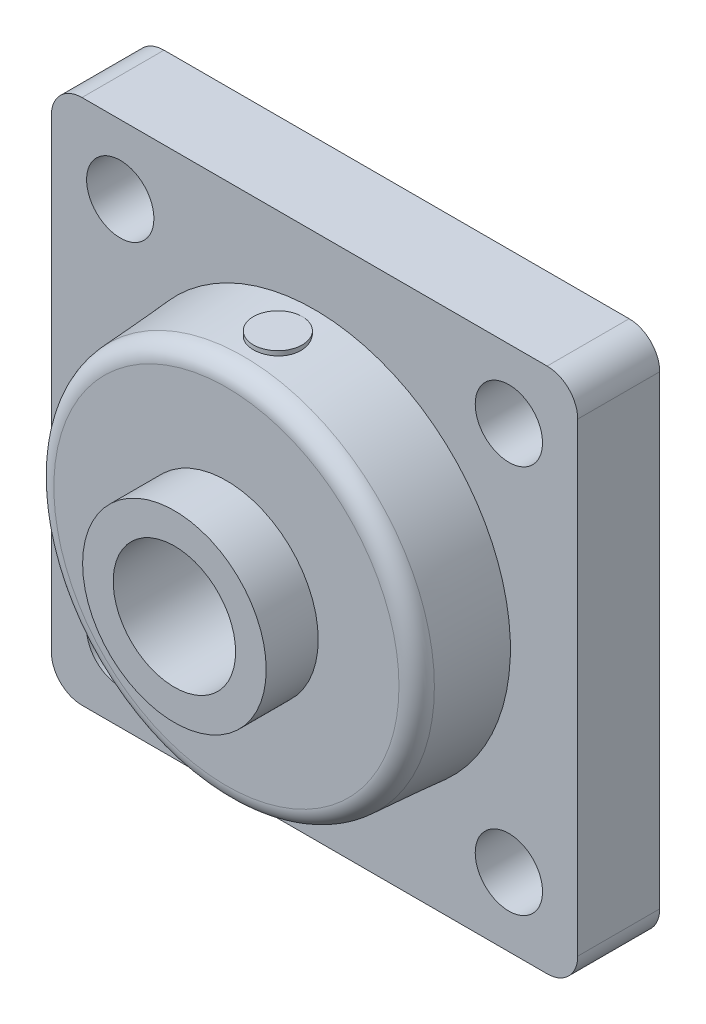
ISO-10303-21;
HEADER;
FILE_DESCRIPTION(('STEP AP214'),'2;1');
FILE_NAME('part.step','',(''),(''),'','','');
FILE_SCHEMA(('AUTOMOTIVE_DESIGN { 1 0 10303 214 1 1 1 1 }'));
ENDSEC;
DATA;
#1=APPLICATION_CONTEXT('core data for automotive mechanical design processes');
#2=APPLICATION_PROTOCOL_DEFINITION('international standard','automotive_design',2000,#1);
#3=PRODUCT_CONTEXT('',#1,'mechanical');
#4=PRODUCT('Part','Part','',(#3));
#5=PRODUCT_RELATED_PRODUCT_CATEGORY('part','',(#4));
#6=PRODUCT_DEFINITION_FORMATION('','',#4);
#7=PRODUCT_DEFINITION_CONTEXT('part definition',#1,'design');
#8=PRODUCT_DEFINITION('design','',#6,#7);
#9=PRODUCT_DEFINITION_SHAPE('','',#8);
#10=(LENGTH_UNIT() NAMED_UNIT(*) SI_UNIT(.MILLI.,.METRE.));
#11=(NAMED_UNIT(*) PLANE_ANGLE_UNIT() SI_UNIT($,.RADIAN.));
#12=(NAMED_UNIT(*) SI_UNIT($,.STERADIAN.) SOLID_ANGLE_UNIT());
#13=UNCERTAINTY_MEASURE_WITH_UNIT(LENGTH_MEASURE(1.E-05),#10,'distance_accuracy_value','');
#14=(GEOMETRIC_REPRESENTATION_CONTEXT(3) GLOBAL_UNCERTAINTY_ASSIGNED_CONTEXT((#13)) GLOBAL_UNIT_ASSIGNED_CONTEXT((#10,
#11,#12)) REPRESENTATION_CONTEXT('',''));
#15=CARTESIAN_POINT('',(0.,0.,0.));
#16=DIRECTION('',(0.,0.,1.));
#17=DIRECTION('',(1.,0.,0.));
#18=AXIS2_PLACEMENT_3D('',#15,#16,#17);
#19=CARTESIAN_POINT('',(0.,0.,13.4));
#20=DIRECTION('',(0.,0.,-1.));
#21=DIRECTION('',(1.,0.,0.));
#22=AXIS2_PLACEMENT_3D('',#19,#20,#21);
#23=CONICAL_SURFACE('',#22,32.,0.0698131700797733);
#24=CARTESIAN_POINT('',(0.,0.,13.4));
#25=DIRECTION('',(0.,0.,-1.));
#26=DIRECTION('',(-1.,0.,0.));
#27=AXIS2_PLACEMENT_3D('',#24,#25,#26);
#28=CIRCLE('',#27,32.);
#29=CARTESIAN_POINT('',(-32.,0.,13.4));
#30=VERTEX_POINT('',#29);
#31=EDGE_CURVE('E133',#30,#30,#28,.F.);
#32=ORIENTED_EDGE('',*,*,#31,.T.);
#33=EDGE_LOOP('',(#32));
#34=FACE_BOUND('',#33,.T.);
#35=CARTESIAN_POINT('',(0.,0.,25.0092694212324));
#36=DIRECTION('',(0.,0.,-1.));
#37=DIRECTION('',(-1.,0.,0.));
#38=AXIS2_PLACEMENT_3D('',#35,#36,#37);
#39=CIRCLE('',#38,31.1882008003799);
#40=CARTESIAN_POINT('',(-31.18820080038,0.,25.0092694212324));
#41=VERTEX_POINT('',#40);
#42=EDGE_CURVE('E55',#41,#41,#39,.T.);
#43=ORIENTED_EDGE('',*,*,#42,.T.);
#44=EDGE_LOOP('',(#43));
#45=FACE_BOUND('',#44,.T.);
#46=CARTESIAN_POINT('',(-2.27490962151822,31.7290569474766,16.1098957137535));
#47=CARTESIAN_POINT('',(-2.46095267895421,31.706697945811,16.2385446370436));
#48=CARTESIAN_POINT('',(-2.63602516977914,31.6823544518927,16.382984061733));
#49=CARTESIAN_POINT('',(-2.95927871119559,31.6315885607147,16.699273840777));
#50=CARTESIAN_POINT('',(-3.10742691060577,31.6051636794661,16.8711572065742));
#51=CARTESIAN_POINT('',(-3.3725345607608,31.5522232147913,17.2373505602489));
#52=CARTESIAN_POINT('',(-3.48951212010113,31.5257076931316,17.4316474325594));
#53=CARTESIAN_POINT('',(-3.68905526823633,31.4744212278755,17.8373229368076));
#54=CARTESIAN_POINT('',(-3.77163013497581,31.4496498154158,18.0486969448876));
#55=CARTESIAN_POINT('',(-3.89999488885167,31.4034035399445,18.482786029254));
#56=CARTESIAN_POINT('',(-3.94576980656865,31.3819300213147,18.7055056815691));
#57=CARTESIAN_POINT('',(-3.99897556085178,31.3434478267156,19.1558671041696));
#58=CARTESIAN_POINT('',(-4.00640729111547,31.3264390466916,19.3835087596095));
#59=CARTESIAN_POINT('',(-3.98265449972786,31.2976629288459,19.8346985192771));
#60=CARTESIAN_POINT('',(-3.95187390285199,31.2858425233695,20.0582645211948));
#61=CARTESIAN_POINT('',(-3.85313665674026,31.2672271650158,20.4972439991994));
#62=CARTESIAN_POINT('',(-3.78518167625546,31.2604319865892,20.7126578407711));
#63=CARTESIAN_POINT('',(-3.6146384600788,31.2514044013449,21.127517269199));
#64=CARTESIAN_POINT('',(-3.51231267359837,31.2491382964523,21.3270700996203));
#65=CARTESIAN_POINT('',(-3.27579971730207,31.2481501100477,21.7063127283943));
#66=CARTESIAN_POINT('',(-3.14161217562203,31.249428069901,21.8860022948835));
#67=CARTESIAN_POINT('',(-2.84486832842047,31.2543312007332,22.2207906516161));
#68=CARTESIAN_POINT('',(-2.68225618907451,31.2579610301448,22.3758398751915));
#69=CARTESIAN_POINT('',(-2.33342198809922,31.2662487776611,22.6565731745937));
#70=CARTESIAN_POINT('',(-2.14719936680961,31.2709067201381,22.7822565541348));
#71=CARTESIAN_POINT('',(-1.7555348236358,31.2800074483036,23.0012000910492));
#72=CARTESIAN_POINT('',(-1.55001500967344,31.2844492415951,23.094320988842));
#73=CARTESIAN_POINT('',(-1.12624067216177,31.2920429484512,23.244754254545));
#74=CARTESIAN_POINT('',(-0.907986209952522,31.2951948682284,23.3020667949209));
#75=CARTESIAN_POINT('',(-0.464941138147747,31.2995135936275,23.3792446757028));
#76=CARTESIAN_POINT('',(-0.240150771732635,31.3006804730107,23.3991114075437));
#77=CARTESIAN_POINT('',(0.209574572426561,31.3007799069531,23.4008301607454));
#78=CARTESIAN_POINT('',(0.434509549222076,31.2997124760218,23.3826824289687));
#79=CARTESIAN_POINT('',(0.877822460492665,31.2955741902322,23.3089450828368));
#80=CARTESIAN_POINT('',(1.09620883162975,31.2925060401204,23.2534060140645));
#81=CARTESIAN_POINT('',(1.52056518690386,31.2850423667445,23.1065208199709));
#82=CARTESIAN_POINT('',(1.7265349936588,31.2806468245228,23.0151741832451));
#83=CARTESIAN_POINT('',(2.12048740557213,31.2715575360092,22.7991268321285));
#84=CARTESIAN_POINT('',(2.30844787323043,31.2668634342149,22.67438576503));
#85=CARTESIAN_POINT('',(2.66078858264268,31.2584526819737,22.395118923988));
#86=CARTESIAN_POINT('',(2.8251687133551,31.2547360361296,22.2405930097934));
#87=CARTESIAN_POINT('',(3.12574113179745,31.2496201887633,21.906057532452));
#88=CARTESIAN_POINT('',(3.2619226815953,31.2482218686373,21.7260383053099));
#89=CARTESIAN_POINT('',(3.50212137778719,31.2489786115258,21.3456952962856));
#90=CARTESIAN_POINT('',(3.60613964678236,31.2511335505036,21.1453722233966));
#91=CARTESIAN_POINT('',(3.77869500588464,31.2599244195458,20.7310246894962));
#92=CARTESIAN_POINT('',(3.84737299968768,31.26654230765,20.5170585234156));
#93=CARTESIAN_POINT('',(3.94797675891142,31.2847432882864,20.0808630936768));
#94=CARTESIAN_POINT('',(3.97990344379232,31.2963262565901,19.8586340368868));
#95=CARTESIAN_POINT('',(4.00619037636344,31.324397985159,19.4128591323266));
#96=CARTESIAN_POINT('',(4.0006471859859,31.3408740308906,19.1893181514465));
#97=CARTESIAN_POINT('',(3.95255408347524,31.3781758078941,18.7466277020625));
#98=CARTESIAN_POINT('',(3.91000272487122,31.3990017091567,18.5274784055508));
#99=CARTESIAN_POINT('',(3.7888424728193,31.4440890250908,18.0981746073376));
#100=CARTESIAN_POINT('',(3.70999608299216,31.4683723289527,17.8880894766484));
#101=CARTESIAN_POINT('',(3.51846933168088,31.5187796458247,17.484187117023));
#102=CARTESIAN_POINT('',(3.40578631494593,31.5449038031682,17.2903711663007));
#103=CARTESIAN_POINT('',(3.1482920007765,31.5975154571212,16.9222479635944));
#104=CARTESIAN_POINT('',(3.00314477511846,31.6240038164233,16.7481756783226));
#105=CARTESIAN_POINT('',(2.68541137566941,31.6751157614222,16.426850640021));
#106=CARTESIAN_POINT('',(2.512824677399,31.6997393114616,16.2795983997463));
#107=CARTESIAN_POINT('',(2.14482831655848,31.7452305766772,16.0160746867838));
#108=CARTESIAN_POINT('',(1.94940644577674,31.7660962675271,15.8998198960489));
#109=CARTESIAN_POINT('',(1.54129925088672,31.8023638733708,15.7019182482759));
#110=CARTESIAN_POINT('',(1.32861610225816,31.8177664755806,15.6202670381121));
#111=CARTESIAN_POINT('',(0.89522261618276,31.8416468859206,15.4950370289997));
#112=CARTESIAN_POINT('',(0.67466855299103,31.8502196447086,15.4509355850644));
#113=CARTESIAN_POINT('',(0.229084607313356,31.8600823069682,15.4002764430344));
#114=CARTESIAN_POINT('',(0.00405419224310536,31.8613713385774,15.3937232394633));
#115=CARTESIAN_POINT('',(-0.440806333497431,31.8565903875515,15.4182071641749));
#116=CARTESIAN_POINT('',(-0.660665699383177,31.8506189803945,15.4487407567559));
#117=CARTESIAN_POINT('',(-1.09188953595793,31.8319744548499,15.5455850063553));
#118=CARTESIAN_POINT('',(-1.30326254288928,31.819308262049,15.6118586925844));
#119=CARTESIAN_POINT('',(-1.6425993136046,31.7935652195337,15.7499025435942));
#120=CARTESIAN_POINT('',(-1.7746092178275,31.782073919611,15.812245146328));
#121=CARTESIAN_POINT('',(-2.03089729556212,31.7570147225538,15.9508435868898));
#122=CARTESIAN_POINT('',(-2.15517545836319,31.7434468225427,16.0270994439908));
#123=CARTESIAN_POINT('',(-2.27490962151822,31.7290569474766,16.1098957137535));
#124=B_SPLINE_CURVE_WITH_KNOTS('',3,(#46,#47,#48,#49,#50,#51,#52,#53,#54,#55,#56,#57,#58,#59,
#60,#61,#62,#63,#64,#65,#66,#67,#68,#69,#70,#71,#72,#73,#74,#75,#76,#77,#78,#79,#80,#81,#82,#83,
#84,#85,#86,#87,#88,#89,#90,#91,#92,#93,#94,#95,#96,#97,#98,#99,#100,#101,#102,#103,#104,#105,
#106,#107,#108,#109,#110,#111,#112,#113,#114,#115,#116,#117,#118,#119,#120,#121,#122,#123),
.UNSPECIFIED.,.T.,.F.,(4,2,2,2,2,2,2,2,2,2,2,2,2,2,2,2,2,2,2,2,2,2,2,2,2,2,2,2,2,2,2,2,2,2,2,2,
2,2,4),(0.,0.681344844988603,1.36351551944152,2.04528901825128,2.7268785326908,3.40874516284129,
4.09059590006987,4.76530008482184,5.43997398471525,6.10960907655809,6.77925198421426,
7.45022534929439,8.12121462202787,8.79503938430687,9.46886090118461,10.1426573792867,
10.8164494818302,11.4893325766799,12.1622252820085,12.8359347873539,13.509647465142,
14.1836162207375,14.857561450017,15.5287983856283,16.2000185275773,16.8695095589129,
17.5390267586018,18.2129886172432,18.8870033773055,19.5683448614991,20.2496993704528,
20.9314198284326,21.6130545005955,22.2850389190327,22.9571037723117,23.620144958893,
24.2825015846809,24.7210029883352,25.1595049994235),.UNSPECIFIED.);
#125=CARTESIAN_POINT('',(-2.27490962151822,31.7290569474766,16.1098957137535));
#126=VERTEX_POINT('',#125);
#127=EDGE_CURVE('E11',#126,#126,#124,.T.);
#128=ORIENTED_EDGE('',*,*,#127,.F.);
#129=EDGE_LOOP('',(#128));
#130=FACE_BOUND('',#129,.T.);
#131=ADVANCED_FACE('F42',(#34,#45,#130),#23,.T.);
#132=CARTESIAN_POINT('',(0.,0.,27.8));
#133=DIRECTION('',(0.,0.,1.));
#134=DIRECTION('',(1.,0.,0.));
#135=AXIS2_PLACEMENT_3D('',#132,#133,#134);
#136=PLANE('',#135);
#137=CARTESIAN_POINT('',(0.,0.,27.8));
#138=DIRECTION('',(0.,0.,1.));
#139=DIRECTION('',(1.,0.,0.));
#140=AXIS2_PLACEMENT_3D('',#137,#138,#139);
#141=CIRCLE('',#140,28.1955086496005);
#142=CARTESIAN_POINT('',(28.1955086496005,0.,27.8));
#143=VERTEX_POINT('',#142);
#144=EDGE_CURVE('E214',#143,#143,#141,.T.);
#145=ORIENTED_EDGE('',*,*,#144,.T.);
#146=EDGE_LOOP('',(#145));
#147=FACE_BOUND('',#146,.T.);
#148=CARTESIAN_POINT('',(0.,0.,27.8));
#149=DIRECTION('',(0.,0.,1.));
#150=DIRECTION('',(1.,0.,0.));
#151=AXIS2_PLACEMENT_3D('',#148,#149,#150);
#152=CIRCLE('',#151,15.);
#153=CARTESIAN_POINT('',(15.,0.,27.8));
#154=VERTEX_POINT('',#153);
#155=EDGE_CURVE('E237',#154,#154,#152,.T.);
#156=ORIENTED_EDGE('',*,*,#155,.F.);
#157=EDGE_LOOP('',(#156));
#158=FACE_BOUND('',#157,.T.);
#159=ADVANCED_FACE('F230',(#147,#158),#136,.T.);
#160=CARTESIAN_POINT('',(38.,-38.,13.4));
#161=DIRECTION('',(0.,0.,-1.));
#162=DIRECTION('',(-1.,0.,0.));
#163=AXIS2_PLACEMENT_3D('',#160,#161,#162);
#164=PLANE('',#163);
#165=CARTESIAN_POINT('',(31.7499999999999,-31.7499999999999,13.4));
#166=DIRECTION('',(0.,0.,1.));
#167=DIRECTION('',(-1.,0.,0.));
#168=AXIS2_PLACEMENT_3D('',#165,#166,#167);
#169=CIRCLE('',#168,5.5);
#170=CARTESIAN_POINT('',(26.2499999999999,-31.7499999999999,13.4));
#171=VERTEX_POINT('',#170);
#172=EDGE_CURVE('E257',#171,#171,#169,.T.);
#173=ORIENTED_EDGE('',*,*,#172,.F.);
#174=EDGE_LOOP('',(#173));
#175=FACE_BOUND('',#174,.T.);
#176=CARTESIAN_POINT('',(31.7499999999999,31.7499999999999,13.4));
#177=DIRECTION('',(0.,0.,1.));
#178=DIRECTION('',(-1.,0.,0.));
#179=AXIS2_PLACEMENT_3D('',#176,#177,#178);
#180=CIRCLE('',#179,5.5);
#181=CARTESIAN_POINT('',(26.2499999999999,31.7499999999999,13.4));
#182=VERTEX_POINT('',#181);
#183=EDGE_CURVE('E272',#182,#182,#180,.T.);
#184=ORIENTED_EDGE('',*,*,#183,.F.);
#185=EDGE_LOOP('',(#184));
#186=FACE_BOUND('',#185,.T.);
#187=CARTESIAN_POINT('',(38.,-38.,13.4));
#188=DIRECTION('',(0.,0.,1.));
#189=DIRECTION('',(-1.,0.,0.));
#190=AXIS2_PLACEMENT_3D('',#187,#188,#189);
#191=CIRCLE('',#190,5.);
#192=CARTESIAN_POINT('',(38.,-43.,13.4));
#193=VERTEX_POINT('',#192);
#194=CARTESIAN_POINT('',(42.9999999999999,-38.,13.4));
#195=VERTEX_POINT('',#194);
#196=EDGE_CURVE('E166',#193,#195,#191,.T.);
#197=ORIENTED_EDGE('',*,*,#196,.T.);
#198=DIRECTION('',(0.,1.,0.));
#199=VECTOR('',#198,1.);
#200=CARTESIAN_POINT('',(42.9999999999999,-38.,13.4));
#201=LINE('',#200,#199);
#202=CARTESIAN_POINT('',(42.9999999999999,38.,13.4));
#203=VERTEX_POINT('',#202);
#204=EDGE_CURVE('E129',#195,#203,#201,.T.);
#205=ORIENTED_EDGE('',*,*,#204,.T.);
#206=CARTESIAN_POINT('',(38.,37.9999999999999,13.4));
#207=DIRECTION('',(0.,0.,1.));
#208=DIRECTION('',(-1.,0.,0.));
#209=AXIS2_PLACEMENT_3D('',#206,#207,#208);
#210=CIRCLE('',#209,5.);
#211=CARTESIAN_POINT('',(38.,42.9999999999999,13.4));
#212=VERTEX_POINT('',#211);
#213=EDGE_CURVE('E171',#203,#212,#210,.T.);
#214=ORIENTED_EDGE('',*,*,#213,.T.);
#215=DIRECTION('',(-1.,0.,0.));
#216=VECTOR('',#215,1.);
#217=CARTESIAN_POINT('',(-38.,43.,13.4));
#218=LINE('',#217,#216);
#219=CARTESIAN_POINT('',(-38.,43.,13.4));
#220=VERTEX_POINT('',#219);
#221=EDGE_CURVE('E174',#212,#220,#218,.T.);
#222=ORIENTED_EDGE('',*,*,#221,.T.);
#223=CARTESIAN_POINT('',(-38.,38.,13.4));
#224=DIRECTION('',(0.,0.,1.));
#225=DIRECTION('',(1.,0.,0.));
#226=AXIS2_PLACEMENT_3D('',#223,#224,#225);
#227=CIRCLE('',#226,5.);
#228=CARTESIAN_POINT('',(-42.9999999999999,37.9999999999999,13.4));
#229=VERTEX_POINT('',#228);
#230=EDGE_CURVE('E177',#220,#229,#227,.T.);
#231=ORIENTED_EDGE('',*,*,#230,.T.);
#232=DIRECTION('',(0.,-1.,0.));
#233=VECTOR('',#232,1.);
#234=CARTESIAN_POINT('',(-42.9999999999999,-38.,13.4));
#235=LINE('',#234,#233);
#236=CARTESIAN_POINT('',(-42.9999999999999,-38.,13.4));
#237=VERTEX_POINT('',#236);
#238=EDGE_CURVE('E180',#229,#237,#235,.T.);
#239=ORIENTED_EDGE('',*,*,#238,.T.);
#240=CARTESIAN_POINT('',(-38.,-38.,13.4));
#241=DIRECTION('',(0.,0.,1.));
#242=DIRECTION('',(1.,0.,0.));
#243=AXIS2_PLACEMENT_3D('',#240,#241,#242);
#244=CIRCLE('',#243,5.);
#245=CARTESIAN_POINT('',(-38.,-43.,13.4));
#246=VERTEX_POINT('',#245);
#247=EDGE_CURVE('E67',#237,#246,#244,.T.);
#248=ORIENTED_EDGE('',*,*,#247,.T.);
#249=DIRECTION('',(1.,0.,0.));
#250=VECTOR('',#249,1.);
#251=CARTESIAN_POINT('',(-38.,-43.,13.4));
#252=LINE('',#251,#250);
#253=EDGE_CURVE('E62',#246,#193,#252,.T.);
#254=ORIENTED_EDGE('',*,*,#253,.T.);
#255=EDGE_LOOP('',(#197,#205,#214,#222,#231,#239,#248,#254));
#256=FACE_BOUND('',#255,.T.);
#257=CARTESIAN_POINT('',(-31.7499999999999,31.7499999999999,13.4));
#258=DIRECTION('',(0.,0.,1.));
#259=DIRECTION('',(1.,0.,0.));
#260=AXIS2_PLACEMENT_3D('',#257,#258,#259);
#261=CIRCLE('',#260,5.5);
#262=CARTESIAN_POINT('',(-26.2499999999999,31.7499999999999,13.4));
#263=VERTEX_POINT('',#262);
#264=EDGE_CURVE('E139',#263,#263,#261,.T.);
#265=ORIENTED_EDGE('',*,*,#264,.F.);
#266=EDGE_LOOP('',(#265));
#267=FACE_BOUND('',#266,.T.);
#268=CARTESIAN_POINT('',(-31.7499999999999,-31.7500000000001,13.4));
#269=DIRECTION('',(0.,0.,1.));
#270=DIRECTION('',(1.,0.,0.));
#271=AXIS2_PLACEMENT_3D('',#268,#269,#270);
#272=CIRCLE('',#271,5.5);
#273=CARTESIAN_POINT('',(-26.2499999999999,-31.7500000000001,13.4));
#274=VERTEX_POINT('',#273);
#275=EDGE_CURVE('E264',#274,#274,#272,.T.);
#276=ORIENTED_EDGE('',*,*,#275,.F.);
#277=EDGE_LOOP('',(#276));
#278=FACE_BOUND('',#277,.T.);
#279=ORIENTED_EDGE('',*,*,#31,.F.);
#280=EDGE_LOOP('',(#279));
#281=FACE_BOUND('',#280,.T.);
#282=ADVANCED_FACE('F233',(#175,#186,#256,#267,#278,#281),#164,.F.);
#283=CARTESIAN_POINT('',(38.,-38.,0.));
#284=DIRECTION('',(0.,0.,-1.));
#285=DIRECTION('',(-1.,0.,0.));
#286=AXIS2_PLACEMENT_3D('',#283,#284,#285);
#287=PLANE('',#286);
#288=CARTESIAN_POINT('',(0.,0.,0.));
#289=DIRECTION('',(0.,0.,1.));
#290=DIRECTION('',(1.,0.,0.));
#291=AXIS2_PLACEMENT_3D('',#288,#289,#290);
#292=CIRCLE('',#291,10.);
#293=CARTESIAN_POINT('',(10.,0.,0.));
#294=VERTEX_POINT('',#293);
#295=EDGE_CURVE('E250',#294,#294,#292,.T.);
#296=ORIENTED_EDGE('',*,*,#295,.T.);
#297=EDGE_LOOP('',(#296));
#298=FACE_BOUND('',#297,.T.);
#299=CARTESIAN_POINT('',(-31.7499999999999,-31.7500000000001,0.));
#300=DIRECTION('',(0.,0.,1.));
#301=DIRECTION('',(1.,0.,0.));
#302=AXIS2_PLACEMENT_3D('',#299,#300,#301);
#303=CIRCLE('',#302,5.5);
#304=CARTESIAN_POINT('',(-26.2499999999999,-31.7500000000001,0.));
#305=VERTEX_POINT('',#304);
#306=EDGE_CURVE('E261',#305,#305,#303,.T.);
#307=ORIENTED_EDGE('',*,*,#306,.T.);
#308=EDGE_LOOP('',(#307));
#309=FACE_BOUND('',#308,.T.);
#310=CARTESIAN_POINT('',(-31.7499999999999,31.7499999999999,0.));
#311=DIRECTION('',(0.,0.,1.));
#312=DIRECTION('',(1.,0.,0.));
#313=AXIS2_PLACEMENT_3D('',#310,#311,#312);
#314=CIRCLE('',#313,5.5);
#315=CARTESIAN_POINT('',(-26.2499999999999,31.7499999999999,0.));
#316=VERTEX_POINT('',#315);
#317=EDGE_CURVE('E145',#316,#316,#314,.T.);
#318=ORIENTED_EDGE('',*,*,#317,.T.);
#319=EDGE_LOOP('',(#318));
#320=FACE_BOUND('',#319,.T.);
#321=CARTESIAN_POINT('',(38.,-38.,0.));
#322=DIRECTION('',(0.,0.,1.));
#323=DIRECTION('',(-1.,0.,0.));
#324=AXIS2_PLACEMENT_3D('',#321,#322,#323);
#325=CIRCLE('',#324,5.);
#326=CARTESIAN_POINT('',(38.,-43.,0.));
#327=VERTEX_POINT('',#326);
#328=CARTESIAN_POINT('',(42.9999999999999,-38.,0.));
#329=VERTEX_POINT('',#328);
#330=EDGE_CURVE('E118',#327,#329,#325,.T.);
#331=ORIENTED_EDGE('',*,*,#330,.F.);
#332=DIRECTION('',(1.,0.,0.));
#333=VECTOR('',#332,1.);
#334=CARTESIAN_POINT('',(-38.,-43.,0.));
#335=LINE('',#334,#333);
#336=CARTESIAN_POINT('',(-38.,-43.,0.));
#337=VERTEX_POINT('',#336);
#338=EDGE_CURVE('E163',#337,#327,#335,.T.);
#339=ORIENTED_EDGE('',*,*,#338,.F.);
#340=CARTESIAN_POINT('',(-38.,-38.,0.));
#341=DIRECTION('',(0.,0.,1.));
#342=DIRECTION('',(1.,0.,0.));
#343=AXIS2_PLACEMENT_3D('',#340,#341,#342);
#344=CIRCLE('',#343,5.);
#345=CARTESIAN_POINT('',(-42.9999999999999,-38.,0.));
#346=VERTEX_POINT('',#345);
#347=EDGE_CURVE('E160',#346,#337,#344,.T.);
#348=ORIENTED_EDGE('',*,*,#347,.F.);
#349=DIRECTION('',(0.,-1.,0.));
#350=VECTOR('',#349,1.);
#351=CARTESIAN_POINT('',(-42.9999999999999,-38.,0.));
#352=LINE('',#351,#350);
#353=CARTESIAN_POINT('',(-42.9999999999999,37.9999999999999,0.));
#354=VERTEX_POINT('',#353);
#355=EDGE_CURVE('E157',#354,#346,#352,.T.);
#356=ORIENTED_EDGE('',*,*,#355,.F.);
#357=CARTESIAN_POINT('',(-38.,38.,0.));
#358=DIRECTION('',(0.,0.,1.));
#359=DIRECTION('',(1.,0.,0.));
#360=AXIS2_PLACEMENT_3D('',#357,#358,#359);
#361=CIRCLE('',#360,5.);
#362=CARTESIAN_POINT('',(-38.,43.,0.));
#363=VERTEX_POINT('',#362);
#364=EDGE_CURVE('E154',#363,#354,#361,.T.);
#365=ORIENTED_EDGE('',*,*,#364,.F.);
#366=DIRECTION('',(-1.,0.,0.));
#367=VECTOR('',#366,1.);
#368=CARTESIAN_POINT('',(-38.,43.,0.));
#369=LINE('',#368,#367);
#370=CARTESIAN_POINT('',(38.,42.9999999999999,0.));
#371=VERTEX_POINT('',#370);
#372=EDGE_CURVE('E151',#371,#363,#369,.T.);
#373=ORIENTED_EDGE('',*,*,#372,.F.);
#374=CARTESIAN_POINT('',(38.,37.9999999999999,0.));
#375=DIRECTION('',(0.,0.,1.));
#376=DIRECTION('',(-1.,0.,0.));
#377=AXIS2_PLACEMENT_3D('',#374,#375,#376);
#378=CIRCLE('',#377,5.);
#379=CARTESIAN_POINT('',(42.9999999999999,38.,0.));
#380=VERTEX_POINT('',#379);
#381=EDGE_CURVE('E120',#380,#371,#378,.T.);
#382=ORIENTED_EDGE('',*,*,#381,.F.);
#383=DIRECTION('',(0.,1.,0.));
#384=VECTOR('',#383,1.);
#385=CARTESIAN_POINT('',(42.9999999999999,-38.,0.));
#386=LINE('',#385,#384);
#387=EDGE_CURVE('E112',#329,#380,#386,.T.);
#388=ORIENTED_EDGE('',*,*,#387,.F.);
#389=EDGE_LOOP('',(#331,#339,#348,#356,#365,#373,#382,#388));
#390=FACE_BOUND('',#389,.T.);
#391=CARTESIAN_POINT('',(31.7499999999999,31.7499999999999,0.));
#392=DIRECTION('',(0.,0.,1.));
#393=DIRECTION('',(-1.,0.,0.));
#394=AXIS2_PLACEMENT_3D('',#391,#392,#393);
#395=CIRCLE('',#394,5.5);
#396=CARTESIAN_POINT('',(26.2499999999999,31.7499999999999,0.));
#397=VERTEX_POINT('',#396);
#398=EDGE_CURVE('E268',#397,#397,#395,.T.);
#399=ORIENTED_EDGE('',*,*,#398,.T.);
#400=EDGE_LOOP('',(#399));
#401=FACE_BOUND('',#400,.T.);
#402=CARTESIAN_POINT('',(31.7499999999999,-31.7499999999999,0.));
#403=DIRECTION('',(0.,0.,1.));
#404=DIRECTION('',(-1.,0.,0.));
#405=AXIS2_PLACEMENT_3D('',#402,#403,#404);
#406=CIRCLE('',#405,5.5);
#407=CARTESIAN_POINT('',(26.2499999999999,-31.7499999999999,0.));
#408=VERTEX_POINT('',#407);
#409=EDGE_CURVE('E246',#408,#408,#406,.T.);
#410=ORIENTED_EDGE('',*,*,#409,.T.);
#411=EDGE_LOOP('',(#410));
#412=FACE_BOUND('',#411,.T.);
#413=ADVANCED_FACE('F114',(#298,#309,#320,#390,#401,#412),#287,.T.);
#414=CARTESIAN_POINT('',(38.,-38.,13.4));
#415=DIRECTION('',(0.,0.,-1.));
#416=DIRECTION('',(-1.,0.,0.));
#417=AXIS2_PLACEMENT_3D('',#414,#415,#416);
#418=CYLINDRICAL_SURFACE('',#417,5.);
#419=ORIENTED_EDGE('',*,*,#330,.T.);
#420=DIRECTION('',(0.,0.,-1.));
#421=VECTOR('',#420,1.);
#422=CARTESIAN_POINT('',(42.9999999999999,-38.,13.4));
#423=LINE('',#422,#421);
#424=EDGE_CURVE('E127',#195,#329,#423,.T.);
#425=ORIENTED_EDGE('',*,*,#424,.F.);
#426=ORIENTED_EDGE('',*,*,#196,.F.);
#427=DIRECTION('',(0.,0.,-1.));
#428=VECTOR('',#427,1.);
#429=CARTESIAN_POINT('',(38.,-43.,13.4));
#430=LINE('',#429,#428);
#431=EDGE_CURVE('E137',#193,#327,#430,.T.);
#432=ORIENTED_EDGE('',*,*,#431,.T.);
#433=EDGE_LOOP('',(#419,#425,#426,#432));
#434=FACE_BOUND('',#433,.T.);
#435=ADVANCED_FACE('F44',(#434),#418,.T.);
#436=CARTESIAN_POINT('',(42.9999999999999,-38.,13.4));
#437=DIRECTION('',(-1.,0.,0.));
#438=DIRECTION('',(0.,0.,1.));
#439=AXIS2_PLACEMENT_3D('',#436,#437,#438);
#440=PLANE('',#439);
#441=ORIENTED_EDGE('',*,*,#387,.T.);
#442=DIRECTION('',(0.,0.,-1.));
#443=VECTOR('',#442,1.);
#444=CARTESIAN_POINT('',(42.9999999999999,38.,13.4));
#445=LINE('',#444,#443);
#446=EDGE_CURVE('E134',#203,#380,#445,.T.);
#447=ORIENTED_EDGE('',*,*,#446,.F.);
#448=ORIENTED_EDGE('',*,*,#204,.F.);
#449=ORIENTED_EDGE('',*,*,#424,.T.);
#450=EDGE_LOOP('',(#441,#447,#448,#449));
#451=FACE_BOUND('',#450,.T.);
#452=ADVANCED_FACE('F128',(#451),#440,.F.);
#453=CARTESIAN_POINT('',(38.,37.9999999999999,13.4));
#454=DIRECTION('',(0.,0.,-1.));
#455=DIRECTION('',(-1.,0.,0.));
#456=AXIS2_PLACEMENT_3D('',#453,#454,#455);
#457=CYLINDRICAL_SURFACE('',#456,5.);
#458=ORIENTED_EDGE('',*,*,#381,.T.);
#459=DIRECTION('',(0.,0.,-1.));
#460=VECTOR('',#459,1.);
#461=CARTESIAN_POINT('',(38.,42.9999999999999,13.4));
#462=LINE('',#461,#460);
#463=EDGE_CURVE('E205',#212,#371,#462,.T.);
#464=ORIENTED_EDGE('',*,*,#463,.F.);
#465=ORIENTED_EDGE('',*,*,#213,.F.);
#466=ORIENTED_EDGE('',*,*,#446,.T.);
#467=EDGE_LOOP('',(#458,#464,#465,#466));
#468=FACE_BOUND('',#467,.T.);
#469=ADVANCED_FACE('F337',(#468),#457,.T.);
#470=CARTESIAN_POINT('',(-38.,43.,13.4));
#471=DIRECTION('',(0.,-1.,0.));
#472=DIRECTION('',(0.,0.,-1.));
#473=AXIS2_PLACEMENT_3D('',#470,#471,#472);
#474=PLANE('',#473);
#475=ORIENTED_EDGE('',*,*,#372,.T.);
#476=DIRECTION('',(0.,0.,-1.));
#477=VECTOR('',#476,1.);
#478=CARTESIAN_POINT('',(-38.,43.,13.4));
#479=LINE('',#478,#477);
#480=EDGE_CURVE('E201',#220,#363,#479,.T.);
#481=ORIENTED_EDGE('',*,*,#480,.F.);
#482=ORIENTED_EDGE('',*,*,#221,.F.);
#483=ORIENTED_EDGE('',*,*,#463,.T.);
#484=EDGE_LOOP('',(#475,#481,#482,#483));
#485=FACE_BOUND('',#484,.T.);
#486=ADVANCED_FACE('F333',(#485),#474,.F.);
#487=CARTESIAN_POINT('',(-38.,38.,13.4));
#488=DIRECTION('',(0.,0.,-1.));
#489=DIRECTION('',(-1.,0.,0.));
#490=AXIS2_PLACEMENT_3D('',#487,#488,#489);
#491=CYLINDRICAL_SURFACE('',#490,5.);
#492=ORIENTED_EDGE('',*,*,#364,.T.);
#493=DIRECTION('',(0.,0.,-1.));
#494=VECTOR('',#493,1.);
#495=CARTESIAN_POINT('',(-42.9999999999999,37.9999999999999,13.4));
#496=LINE('',#495,#494);
#497=EDGE_CURVE('E197',#229,#354,#496,.T.);
#498=ORIENTED_EDGE('',*,*,#497,.F.);
#499=ORIENTED_EDGE('',*,*,#230,.F.);
#500=ORIENTED_EDGE('',*,*,#480,.T.);
#501=EDGE_LOOP('',(#492,#498,#499,#500));
#502=FACE_BOUND('',#501,.T.);
#503=ADVANCED_FACE('F329',(#502),#491,.T.);
#504=CARTESIAN_POINT('',(-42.9999999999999,-38.,13.4));
#505=DIRECTION('',(1.,0.,0.));
#506=DIRECTION('',(0.,0.,-1.));
#507=AXIS2_PLACEMENT_3D('',#504,#505,#506);
#508=PLANE('',#507);
#509=ORIENTED_EDGE('',*,*,#355,.T.);
#510=DIRECTION('',(0.,0.,-1.));
#511=VECTOR('',#510,1.);
#512=CARTESIAN_POINT('',(-42.9999999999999,-38.,13.4));
#513=LINE('',#512,#511);
#514=EDGE_CURVE('E193',#237,#346,#513,.T.);
#515=ORIENTED_EDGE('',*,*,#514,.F.);
#516=ORIENTED_EDGE('',*,*,#238,.F.);
#517=ORIENTED_EDGE('',*,*,#497,.T.);
#518=EDGE_LOOP('',(#509,#515,#516,#517));
#519=FACE_BOUND('',#518,.T.);
#520=ADVANCED_FACE('F325',(#519),#508,.F.);
#521=CARTESIAN_POINT('',(-38.,-38.,13.4));
#522=DIRECTION('',(0.,0.,-1.));
#523=DIRECTION('',(-1.,0.,0.));
#524=AXIS2_PLACEMENT_3D('',#521,#522,#523);
#525=CYLINDRICAL_SURFACE('',#524,5.);
#526=ORIENTED_EDGE('',*,*,#347,.T.);
#527=DIRECTION('',(0.,0.,-1.));
#528=VECTOR('',#527,1.);
#529=CARTESIAN_POINT('',(-38.,-43.,13.4));
#530=LINE('',#529,#528);
#531=EDGE_CURVE('E189',#246,#337,#530,.T.);
#532=ORIENTED_EDGE('',*,*,#531,.F.);
#533=ORIENTED_EDGE('',*,*,#247,.F.);
#534=ORIENTED_EDGE('',*,*,#514,.T.);
#535=EDGE_LOOP('',(#526,#532,#533,#534));
#536=FACE_BOUND('',#535,.T.);
#537=ADVANCED_FACE('F292',(#536),#525,.T.);
#538=CARTESIAN_POINT('',(-38.,-43.,13.4));
#539=DIRECTION('',(0.,1.,0.));
#540=DIRECTION('',(0.,0.,1.));
#541=AXIS2_PLACEMENT_3D('',#538,#539,#540);
#542=PLANE('',#541);
#543=ORIENTED_EDGE('',*,*,#338,.T.);
#544=ORIENTED_EDGE('',*,*,#431,.F.);
#545=ORIENTED_EDGE('',*,*,#253,.F.);
#546=ORIENTED_EDGE('',*,*,#531,.T.);
#547=EDGE_LOOP('',(#543,#544,#545,#546));
#548=FACE_BOUND('',#547,.T.);
#549=ADVANCED_FACE('F282',(#548),#542,.F.);
#550=CARTESIAN_POINT('',(-31.7499999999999,31.7499999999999,13.4));
#551=DIRECTION('',(0.,0.,-1.));
#552=DIRECTION('',(-1.,0.,0.));
#553=AXIS2_PLACEMENT_3D('',#550,#551,#552);
#554=CYLINDRICAL_SURFACE('',#553,5.5);
#555=ORIENTED_EDGE('',*,*,#264,.T.);
#556=EDGE_LOOP('',(#555));
#557=FACE_BOUND('',#556,.T.);
#558=ORIENTED_EDGE('',*,*,#317,.F.);
#559=EDGE_LOOP('',(#558));
#560=FACE_BOUND('',#559,.T.);
#561=ADVANCED_FACE('F279',(#557,#560),#554,.F.);
#562=CARTESIAN_POINT('',(31.7499999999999,31.7499999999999,13.4));
#563=DIRECTION('',(0.,0.,-1.));
#564=DIRECTION('',(-1.,0.,0.));
#565=AXIS2_PLACEMENT_3D('',#562,#563,#564);
#566=CYLINDRICAL_SURFACE('',#565,5.5);
#567=ORIENTED_EDGE('',*,*,#183,.T.);
#568=EDGE_LOOP('',(#567));
#569=FACE_BOUND('',#568,.T.);
#570=ORIENTED_EDGE('',*,*,#398,.F.);
#571=EDGE_LOOP('',(#570));
#572=FACE_BOUND('',#571,.T.);
#573=ADVANCED_FACE('F281',(#569,#572),#566,.F.);
#574=CARTESIAN_POINT('',(-31.7499999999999,-31.7500000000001,13.4));
#575=DIRECTION('',(0.,0.,-1.));
#576=DIRECTION('',(-1.,0.,0.));
#577=AXIS2_PLACEMENT_3D('',#574,#575,#576);
#578=CYLINDRICAL_SURFACE('',#577,5.5);
#579=ORIENTED_EDGE('',*,*,#275,.T.);
#580=EDGE_LOOP('',(#579));
#581=FACE_BOUND('',#580,.T.);
#582=ORIENTED_EDGE('',*,*,#306,.F.);
#583=EDGE_LOOP('',(#582));
#584=FACE_BOUND('',#583,.T.);
#585=ADVANCED_FACE('F289',(#581,#584),#578,.F.);
#586=CARTESIAN_POINT('',(31.7499999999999,-31.7499999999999,13.4));
#587=DIRECTION('',(0.,0.,-1.));
#588=DIRECTION('',(-1.,0.,0.));
#589=AXIS2_PLACEMENT_3D('',#586,#587,#588);
#590=CYLINDRICAL_SURFACE('',#589,5.5);
#591=ORIENTED_EDGE('',*,*,#172,.T.);
#592=EDGE_LOOP('',(#591));
#593=FACE_BOUND('',#592,.T.);
#594=ORIENTED_EDGE('',*,*,#409,.F.);
#595=EDGE_LOOP('',(#594));
#596=FACE_BOUND('',#595,.T.);
#597=ADVANCED_FACE('F226',(#593,#596),#590,.F.);
#598=CARTESIAN_POINT('',(0.,0.,24.8));
#599=DIRECTION('',(0.,0.,1.));
#600=DIRECTION('',(1.,0.,0.));
#601=AXIS2_PLACEMENT_3D('',#598,#599,#600);
#602=TOROIDAL_SURFACE('',#601,28.1955086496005,3.);
#603=ORIENTED_EDGE('',*,*,#42,.F.);
#604=EDGE_LOOP('',(#603));
#605=FACE_BOUND('',#604,.T.);
#606=ORIENTED_EDGE('',*,*,#144,.F.);
#607=EDGE_LOOP('',(#606));
#608=FACE_BOUND('',#607,.T.);
#609=ADVANCED_FACE('F222',(#605,#608),#602,.T.);
#610=CARTESIAN_POINT('',(0.,0.,36.3));
#611=DIRECTION('',(0.,0.,-1.));
#612=DIRECTION('',(-1.,0.,0.));
#613=AXIS2_PLACEMENT_3D('',#610,#611,#612);
#614=CYLINDRICAL_SURFACE('',#613,15.);
#615=CARTESIAN_POINT('',(0.,0.,36.3));
#616=DIRECTION('',(0.,0.,1.));
#617=DIRECTION('',(1.,0.,0.));
#618=AXIS2_PLACEMENT_3D('',#615,#616,#617);
#619=CIRCLE('',#618,15.);
#620=CARTESIAN_POINT('',(15.,0.,36.3));
#621=VERTEX_POINT('',#620);
#622=EDGE_CURVE('E240',#621,#621,#619,.T.);
#623=ORIENTED_EDGE('',*,*,#622,.F.);
#624=EDGE_LOOP('',(#623));
#625=FACE_BOUND('',#624,.T.);
#626=ORIENTED_EDGE('',*,*,#155,.T.);
#627=EDGE_LOOP('',(#626));
#628=FACE_BOUND('',#627,.T.);
#629=ADVANCED_FACE('F225',(#625,#628),#614,.T.);
#630=CARTESIAN_POINT('',(0.,0.,36.3));
#631=DIRECTION('',(0.,0.,1.));
#632=DIRECTION('',(1.,0.,0.));
#633=AXIS2_PLACEMENT_3D('',#630,#631,#632);
#634=PLANE('',#633);
#635=CARTESIAN_POINT('',(0.,0.,36.3));
#636=DIRECTION('',(0.,0.,1.));
#637=DIRECTION('',(1.,0.,0.));
#638=AXIS2_PLACEMENT_3D('',#635,#636,#637);
#639=CIRCLE('',#638,10.);
#640=CARTESIAN_POINT('',(10.,0.,36.3));
#641=VERTEX_POINT('',#640);
#642=EDGE_CURVE('E514',#641,#641,#639,.T.);
#643=ORIENTED_EDGE('',*,*,#642,.F.);
#644=EDGE_LOOP('',(#643));
#645=FACE_BOUND('',#644,.T.);
#646=ORIENTED_EDGE('',*,*,#622,.T.);
#647=EDGE_LOOP('',(#646));
#648=FACE_BOUND('',#647,.T.);
#649=ADVANCED_FACE('F400',(#645,#648),#634,.T.);
#650=CARTESIAN_POINT('',(0.,32.,19.4));
#651=DIRECTION('',(0.,-1.,0.));
#652=DIRECTION('',(0.,0.,-1.));
#653=AXIS2_PLACEMENT_3D('',#650,#651,#652);
#654=CYLINDRICAL_SURFACE('',#653,4.);
#655=CARTESIAN_POINT('',(0.,32.,19.4));
#656=DIRECTION('',(0.,1.,0.));
#657=DIRECTION('',(0.,0.,1.));
#658=AXIS2_PLACEMENT_3D('',#655,#656,#657);
#659=CIRCLE('',#658,4.);
#660=CARTESIAN_POINT('',(0.,32.,23.4));
#661=VERTEX_POINT('',#660);
#662=EDGE_CURVE('E241',#661,#661,#659,.T.);
#663=ORIENTED_EDGE('',*,*,#662,.F.);
#664=EDGE_LOOP('',(#663));
#665=FACE_BOUND('',#664,.T.);
#666=ORIENTED_EDGE('',*,*,#127,.T.);
#667=EDGE_LOOP('',(#666));
#668=FACE_BOUND('',#667,.T.);
#669=ADVANCED_FACE('F410',(#665,#668),#654,.T.);
#670=CARTESIAN_POINT('',(0.,32.,19.4));
#671=DIRECTION('',(0.,1.,0.));
#672=DIRECTION('',(0.,0.,1.));
#673=AXIS2_PLACEMENT_3D('',#670,#671,#672);
#674=PLANE('',#673);
#675=ORIENTED_EDGE('',*,*,#662,.T.);
#676=EDGE_LOOP('',(#675));
#677=FACE_BOUND('',#676,.T.);
#678=ADVANCED_FACE('F419',(#677),#674,.T.);
#679=CARTESIAN_POINT('',(0.,0.,0.));
#680=DIRECTION('',(0.,0.,1.));
#681=DIRECTION('',(1.,0.,0.));
#682=AXIS2_PLACEMENT_3D('',#679,#680,#681);
#683=CYLINDRICAL_SURFACE('',#682,10.);
#684=ORIENTED_EDGE('',*,*,#295,.F.);
#685=EDGE_LOOP('',(#684));
#686=FACE_BOUND('',#685,.T.);
#687=ORIENTED_EDGE('',*,*,#642,.T.);
#688=EDGE_LOOP('',(#687));
#689=FACE_BOUND('',#688,.T.);
#690=ADVANCED_FACE('F427',(#686,#689),#683,.F.);
#691=CLOSED_SHELL('',(#131,#159,#282,#413,#435,#452,#469,#486,#503,#520,#537,#549,#561,#573,
#585,#597,#609,#629,#649,#669,#678,#690));
#692=MANIFOLD_SOLID_BREP('B2',#691);
#693=ADVANCED_BREP_SHAPE_REPRESENTATION('',(#18,#692),#14);
#694=SHAPE_DEFINITION_REPRESENTATION(#9,#693);
ENDSEC;
END-ISO-10303-21;
